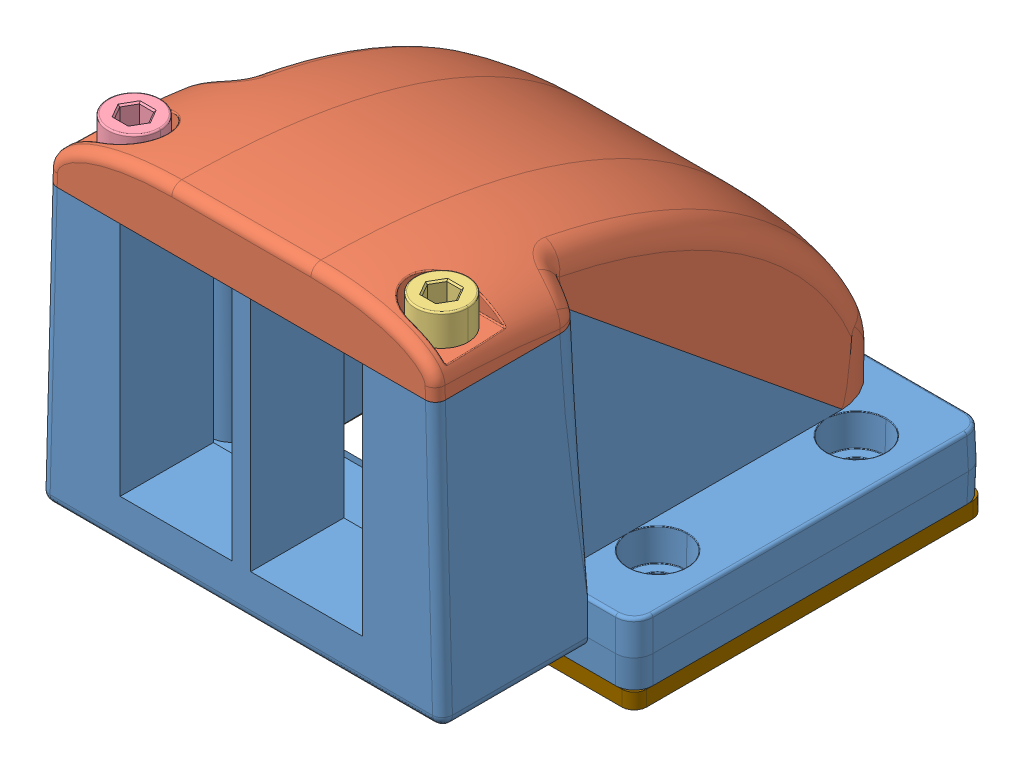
SolidWorks assembly 42344.SLDASM, configuration Default (file format 8000). Lengths in mm.
Overall size (79.78 60.46 80.15).
9 component instances, 9 part files, 0 mates.
Components (placement in the parent):
- 42344_01-1: 42344_01.SLDPRT [Default] at origin size (79.78 50 80.14)
- 42344_02-1: 42344_02.SLDPRT [Default] at origin size (64.51 48.72 79.21)
- 42344_03-1: 42344_03.SLDPRT [Default] at origin size (8.5 17 8.5)
- 42344_04-1: 42344_04.SLDPRT [Default] at origin size (8.5 17 8.5)
- 42344_05-1: 42344_05.SLDPRT [Default] at origin size (8.5 17 8.5)
- 42344_06-1: 42344_06.SLDPRT [Default] at origin size (8.5 17 8.5)
- 42344_07-1: 42344_07.SLDPRT [Default] at origin size (7.2 8.5 7.2)
- 42344_08-1: 42344_08.SLDPRT [Default] at origin size (7.2 8.5 7.2)
- 42344_09-1: 42344_09.SLDPRT [Default] at origin size (79.5 2.5 56.5)
